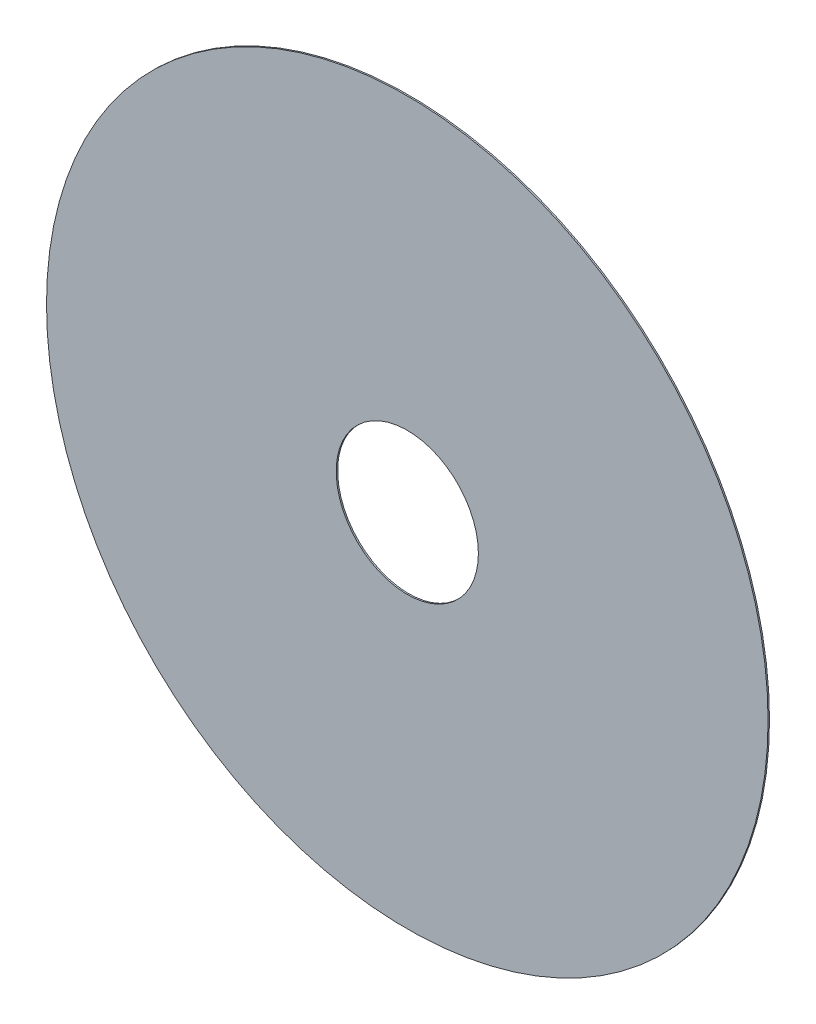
ISO-10303-21;
HEADER;
FILE_DESCRIPTION(('STEP AP214'),'2;1');
FILE_NAME('part.step','',(''),(''),'','','');
FILE_SCHEMA(('AUTOMOTIVE_DESIGN { 1 0 10303 214 1 1 1 1 }'));
ENDSEC;
DATA;
#1=APPLICATION_CONTEXT('core data for automotive mechanical design processes');
#2=APPLICATION_PROTOCOL_DEFINITION('international standard','automotive_design',2000,#1);
#3=PRODUCT_CONTEXT('',#1,'mechanical');
#4=PRODUCT('Part','Part','',(#3));
#5=PRODUCT_RELATED_PRODUCT_CATEGORY('part','',(#4));
#6=PRODUCT_DEFINITION_FORMATION('','',#4);
#7=PRODUCT_DEFINITION_CONTEXT('part definition',#1,'design');
#8=PRODUCT_DEFINITION('design','',#6,#7);
#9=PRODUCT_DEFINITION_SHAPE('','',#8);
#10=(LENGTH_UNIT() NAMED_UNIT(*) SI_UNIT(.MILLI.,.METRE.));
#11=(NAMED_UNIT(*) PLANE_ANGLE_UNIT() SI_UNIT($,.RADIAN.));
#12=(NAMED_UNIT(*) SI_UNIT($,.STERADIAN.) SOLID_ANGLE_UNIT());
#13=UNCERTAINTY_MEASURE_WITH_UNIT(LENGTH_MEASURE(1.E-05),#10,'distance_accuracy_value','');
#14=(GEOMETRIC_REPRESENTATION_CONTEXT(3) GLOBAL_UNCERTAINTY_ASSIGNED_CONTEXT((#13)) GLOBAL_UNIT_ASSIGNED_CONTEXT((#10,
#11,#12)) REPRESENTATION_CONTEXT('',''));
#15=CARTESIAN_POINT('',(0.,0.,0.));
#16=DIRECTION('',(0.,0.,1.));
#17=DIRECTION('',(1.,0.,0.));
#18=AXIS2_PLACEMENT_3D('',#15,#16,#17);
#19=CARTESIAN_POINT('',(0.,0.,-2.));
#20=DIRECTION('',(0.,0.,1.));
#21=DIRECTION('',(1.,0.,0.));
#22=AXIS2_PLACEMENT_3D('',#19,#20,#21);
#23=CYLINDRICAL_SURFACE('',#22,507.5);
#24=CARTESIAN_POINT('',(0.,0.,-2.));
#25=DIRECTION('',(0.,0.,1.));
#26=DIRECTION('',(1.,0.,0.));
#27=AXIS2_PLACEMENT_3D('',#24,#25,#26);
#28=CIRCLE('',#27,507.5);
#29=CARTESIAN_POINT('',(507.5,0.,-2.));
#30=VERTEX_POINT('',#29);
#31=EDGE_CURVE('E10',#30,#30,#28,.T.);
#32=ORIENTED_EDGE('',*,*,#31,.T.);
#33=EDGE_LOOP('',(#32));
#34=FACE_BOUND('',#33,.T.);
#35=CARTESIAN_POINT('',(0.,0.,0.));
#36=DIRECTION('',(0.,0.,1.));
#37=DIRECTION('',(1.,0.,0.));
#38=AXIS2_PLACEMENT_3D('',#35,#36,#37);
#39=CIRCLE('',#38,507.5);
#40=CARTESIAN_POINT('',(507.5,0.,0.));
#41=VERTEX_POINT('',#40);
#42=EDGE_CURVE('E40',#41,#41,#39,.T.);
#43=ORIENTED_EDGE('',*,*,#42,.F.);
#44=EDGE_LOOP('',(#43));
#45=FACE_BOUND('',#44,.T.);
#46=ADVANCED_FACE('F37',(#34,#45),#23,.T.);
#47=CARTESIAN_POINT('',(0.,0.,-2.));
#48=DIRECTION('',(0.,0.,1.));
#49=DIRECTION('',(1.,0.,0.));
#50=AXIS2_PLACEMENT_3D('',#47,#48,#49);
#51=PLANE('',#50);
#52=CARTESIAN_POINT('',(0.,0.,-2.));
#53=DIRECTION('',(0.,0.,1.));
#54=DIRECTION('',(1.,0.,0.));
#55=AXIS2_PLACEMENT_3D('',#52,#53,#54);
#56=CIRCLE('',#55,100.);
#57=CARTESIAN_POINT('',(100.,0.,-2.));
#58=VERTEX_POINT('',#57);
#59=EDGE_CURVE('E47',#58,#58,#56,.T.);
#60=ORIENTED_EDGE('',*,*,#59,.T.);
#61=EDGE_LOOP('',(#60));
#62=FACE_BOUND('',#61,.T.);
#63=ORIENTED_EDGE('',*,*,#31,.F.);
#64=EDGE_LOOP('',(#63));
#65=FACE_BOUND('',#64,.T.);
#66=ADVANCED_FACE('F61',(#62,#65),#51,.F.);
#67=CARTESIAN_POINT('',(0.,0.,0.));
#68=DIRECTION('',(0.,0.,1.));
#69=DIRECTION('',(1.,0.,0.));
#70=AXIS2_PLACEMENT_3D('',#67,#68,#69);
#71=PLANE('',#70);
#72=CARTESIAN_POINT('',(0.,0.,0.));
#73=DIRECTION('',(0.,0.,1.));
#74=DIRECTION('',(1.,0.,0.));
#75=AXIS2_PLACEMENT_3D('',#72,#73,#74);
#76=CIRCLE('',#75,100.);
#77=CARTESIAN_POINT('',(100.,0.,0.));
#78=VERTEX_POINT('',#77);
#79=EDGE_CURVE('E51',#78,#78,#76,.T.);
#80=ORIENTED_EDGE('',*,*,#79,.F.);
#81=EDGE_LOOP('',(#80));
#82=FACE_BOUND('',#81,.T.);
#83=ORIENTED_EDGE('',*,*,#42,.T.);
#84=EDGE_LOOP('',(#83));
#85=FACE_BOUND('',#84,.T.);
#86=ADVANCED_FACE('F58',(#82,#85),#71,.T.);
#87=CARTESIAN_POINT('',(0.,0.,-10.));
#88=DIRECTION('',(0.,0.,1.));
#89=DIRECTION('',(1.,0.,0.));
#90=AXIS2_PLACEMENT_3D('',#87,#88,#89);
#91=CYLINDRICAL_SURFACE('',#90,100.);
#92=ORIENTED_EDGE('',*,*,#79,.T.);
#93=EDGE_LOOP('',(#92));
#94=FACE_BOUND('',#93,.T.);
#95=ORIENTED_EDGE('',*,*,#59,.F.);
#96=EDGE_LOOP('',(#95));
#97=FACE_BOUND('',#96,.T.);
#98=ADVANCED_FACE('F55',(#94,#97),#91,.F.);
#99=CLOSED_SHELL('',(#46,#66,#86,#98));
#100=MANIFOLD_SOLID_BREP('B2',#99);
#101=ADVANCED_BREP_SHAPE_REPRESENTATION('',(#18,#100),#14);
#102=SHAPE_DEFINITION_REPRESENTATION(#9,#101);
ENDSEC;
END-ISO-10303-21;
